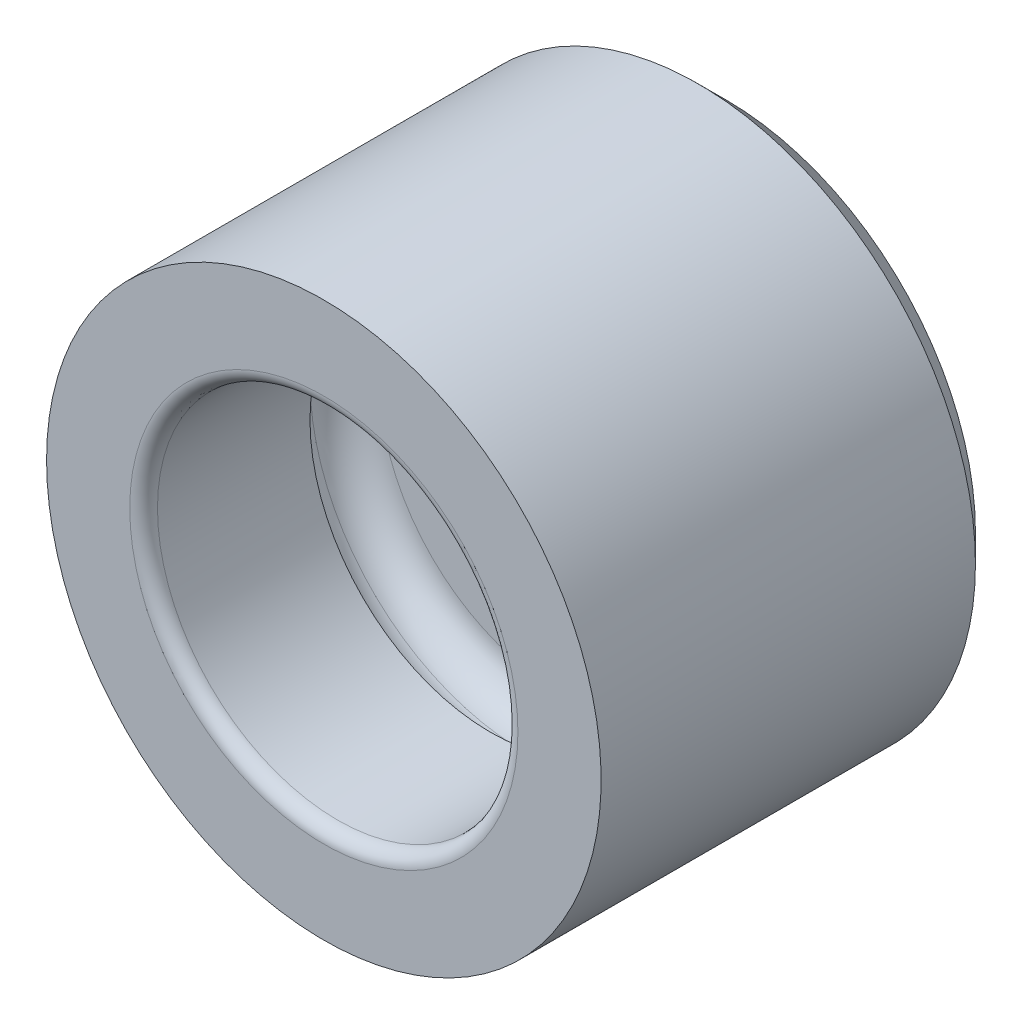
ISO-10303-21;
HEADER;
FILE_DESCRIPTION(('STEP AP214'),'2;1');
FILE_NAME('part.step','',(''),(''),'','','');
FILE_SCHEMA(('AUTOMOTIVE_DESIGN { 1 0 10303 214 1 1 1 1 }'));
ENDSEC;
DATA;
#1=APPLICATION_CONTEXT('core data for automotive mechanical design processes');
#2=APPLICATION_PROTOCOL_DEFINITION('international standard','automotive_design',2000,#1);
#3=PRODUCT_CONTEXT('',#1,'mechanical');
#4=PRODUCT('Part','Part','',(#3));
#5=PRODUCT_RELATED_PRODUCT_CATEGORY('part','',(#4));
#6=PRODUCT_DEFINITION_FORMATION('','',#4);
#7=PRODUCT_DEFINITION_CONTEXT('part definition',#1,'design');
#8=PRODUCT_DEFINITION('design','',#6,#7);
#9=PRODUCT_DEFINITION_SHAPE('','',#8);
#10=(LENGTH_UNIT() NAMED_UNIT(*) SI_UNIT(.MILLI.,.METRE.));
#11=(NAMED_UNIT(*) PLANE_ANGLE_UNIT() SI_UNIT($,.RADIAN.));
#12=(NAMED_UNIT(*) SI_UNIT($,.STERADIAN.) SOLID_ANGLE_UNIT());
#13=UNCERTAINTY_MEASURE_WITH_UNIT(LENGTH_MEASURE(1.E-05),#10,'distance_accuracy_value','');
#14=(GEOMETRIC_REPRESENTATION_CONTEXT(3) GLOBAL_UNCERTAINTY_ASSIGNED_CONTEXT((#13)) GLOBAL_UNIT_ASSIGNED_CONTEXT((#10,
#11,#12)) REPRESENTATION_CONTEXT('',''));
#15=CARTESIAN_POINT('',(0.,0.,0.));
#16=DIRECTION('',(0.,0.,1.));
#17=DIRECTION('',(1.,0.,0.));
#18=AXIS2_PLACEMENT_3D('',#15,#16,#17);
#19=CARTESIAN_POINT('',(0.,0.,-0.5));
#20=DIRECTION('',(0.,0.,-1.));
#21=DIRECTION('',(-1.,0.,0.));
#22=AXIS2_PLACEMENT_3D('',#19,#20,#21);
#23=PLANE('',#22);
#24=CARTESIAN_POINT('',(0.,0.,-0.5));
#25=DIRECTION('',(0.,0.,-1.));
#26=DIRECTION('',(-1.,0.,0.));
#27=AXIS2_PLACEMENT_3D('',#24,#25,#26);
#28=CIRCLE('',#27,7.);
#29=CARTESIAN_POINT('',(-7.,0.,-0.499999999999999));
#30=VERTEX_POINT('',#29);
#31=EDGE_CURVE('E50',#30,#30,#28,.T.);
#32=ORIENTED_EDGE('',*,*,#31,.T.);
#33=EDGE_LOOP('',(#32));
#34=FACE_BOUND('',#33,.T.);
#35=CARTESIAN_POINT('',(0.,0.,-0.5));
#36=DIRECTION('',(0.,0.,-1.));
#37=DIRECTION('',(-1.,0.,0.));
#38=AXIS2_PLACEMENT_3D('',#35,#36,#37);
#39=CIRCLE('',#38,10.);
#40=CARTESIAN_POINT('',(-10.,0.,-0.499999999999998));
#41=VERTEX_POINT('',#40);
#42=EDGE_CURVE('E63',#41,#41,#39,.T.);
#43=ORIENTED_EDGE('',*,*,#42,.F.);
#44=EDGE_LOOP('',(#43));
#45=FACE_BOUND('',#44,.T.);
#46=ADVANCED_FACE('F35',(#34,#45),#23,.F.);
#47=CARTESIAN_POINT('',(0.,0.,-0.5));
#48=DIRECTION('',(0.,0.,-1.));
#49=DIRECTION('',(-1.,0.,0.));
#50=AXIS2_PLACEMENT_3D('',#47,#48,#49);
#51=CYLINDRICAL_SURFACE('',#50,10.);
#52=CARTESIAN_POINT('',(0.,0.,-14.));
#53=DIRECTION('',(0.,0.,1.));
#54=DIRECTION('',(1.,0.,0.));
#55=AXIS2_PLACEMENT_3D('',#52,#53,#54);
#56=CIRCLE('',#55,10.);
#57=CARTESIAN_POINT('',(10.,0.,-14.));
#58=VERTEX_POINT('',#57);
#59=EDGE_CURVE('E10',#58,#58,#56,.T.);
#60=ORIENTED_EDGE('',*,*,#59,.T.);
#61=EDGE_LOOP('',(#60));
#62=FACE_BOUND('',#61,.T.);
#63=ORIENTED_EDGE('',*,*,#42,.T.);
#64=EDGE_LOOP('',(#63));
#65=FACE_BOUND('',#64,.T.);
#66=ADVANCED_FACE('F79',(#62,#65),#51,.T.);
#67=CARTESIAN_POINT('',(0.,0.,-15.));
#68=DIRECTION('',(0.,0.,1.));
#69=DIRECTION('',(1.,0.,0.));
#70=AXIS2_PLACEMENT_3D('',#67,#68,#69);
#71=PLANE('',#70);
#72=CARTESIAN_POINT('',(0.,0.,-15.));
#73=DIRECTION('',(0.,0.,1.));
#74=DIRECTION('',(1.,0.,0.));
#75=AXIS2_PLACEMENT_3D('',#72,#73,#74);
#76=CIRCLE('',#75,9.);
#77=CARTESIAN_POINT('',(9.,0.,-15.));
#78=VERTEX_POINT('',#77);
#79=EDGE_CURVE('E42',#78,#78,#76,.F.);
#80=ORIENTED_EDGE('',*,*,#79,.T.);
#81=EDGE_LOOP('',(#80));
#82=FACE_BOUND('',#81,.T.);
#83=CARTESIAN_POINT('',(0.,0.,-15.));
#84=DIRECTION('',(0.,0.,-1.));
#85=DIRECTION('',(-1.,0.,0.));
#86=AXIS2_PLACEMENT_3D('',#83,#84,#85);
#87=CIRCLE('',#86,2.5);
#88=CARTESIAN_POINT('',(-2.5,0.,-15.));
#89=VERTEX_POINT('',#88);
#90=EDGE_CURVE('E70',#89,#89,#87,.T.);
#91=ORIENTED_EDGE('',*,*,#90,.F.);
#92=EDGE_LOOP('',(#91));
#93=FACE_BOUND('',#92,.T.);
#94=ADVANCED_FACE('F76',(#82,#93),#71,.F.);
#95=CARTESIAN_POINT('',(0.,0.,-9.));
#96=DIRECTION('',(0.,0.,1.));
#97=DIRECTION('',(1.,0.,0.));
#98=AXIS2_PLACEMENT_3D('',#95,#96,#97);
#99=PLANE('',#98);
#100=CARTESIAN_POINT('',(0.,0.,-9.));
#101=DIRECTION('',(0.,0.,1.));
#102=DIRECTION('',(1.,0.,0.));
#103=AXIS2_PLACEMENT_3D('',#100,#101,#102);
#104=CIRCLE('',#103,2.5);
#105=CARTESIAN_POINT('',(2.49999999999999,0.,-9.));
#106=VERTEX_POINT('',#105);
#107=EDGE_CURVE('E60',#106,#106,#104,.T.);
#108=ORIENTED_EDGE('',*,*,#107,.F.);
#109=EDGE_LOOP('',(#108));
#110=FACE_BOUND('',#109,.T.);
#111=CARTESIAN_POINT('',(0.,0.,-9.));
#112=DIRECTION('',(0.,0.,1.));
#113=DIRECTION('',(1.,0.,0.));
#114=AXIS2_PLACEMENT_3D('',#111,#112,#113);
#115=CIRCLE('',#114,6.5);
#116=CARTESIAN_POINT('',(6.5,0.,-9.));
#117=VERTEX_POINT('',#116);
#118=EDGE_CURVE('E55',#117,#117,#115,.T.);
#119=ORIENTED_EDGE('',*,*,#118,.T.);
#120=EDGE_LOOP('',(#119));
#121=FACE_BOUND('',#120,.T.);
#122=ADVANCED_FACE('F78',(#110,#121),#99,.T.);
#123=CARTESIAN_POINT('',(0.,0.,-0.5));
#124=DIRECTION('',(0.,0.,-1.));
#125=DIRECTION('',(-1.,0.,0.));
#126=AXIS2_PLACEMENT_3D('',#123,#124,#125);
#127=CYLINDRICAL_SURFACE('',#126,6.5);
#128=CARTESIAN_POINT('',(0.,0.,-1.));
#129=DIRECTION('',(0.,0.,-1.));
#130=DIRECTION('',(-1.,0.,0.));
#131=AXIS2_PLACEMENT_3D('',#128,#129,#130);
#132=CIRCLE('',#131,6.5);
#133=CARTESIAN_POINT('',(-6.5,0.,-0.999999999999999));
#134=VERTEX_POINT('',#133);
#135=EDGE_CURVE('E46',#134,#134,#132,.F.);
#136=ORIENTED_EDGE('',*,*,#135,.T.);
#137=EDGE_LOOP('',(#136));
#138=FACE_BOUND('',#137,.T.);
#139=CARTESIAN_POINT('',(0.,0.,-6.5));
#140=DIRECTION('',(0.,0.,-1.));
#141=DIRECTION('',(-1.,0.,0.));
#142=AXIS2_PLACEMENT_3D('',#139,#140,#141);
#143=CIRCLE('',#142,6.5);
#144=CARTESIAN_POINT('',(-6.5,0.,-6.5));
#145=VERTEX_POINT('',#144);
#146=EDGE_CURVE('E59',#145,#145,#143,.T.);
#147=ORIENTED_EDGE('',*,*,#146,.T.);
#148=EDGE_LOOP('',(#147));
#149=FACE_BOUND('',#148,.T.);
#150=ADVANCED_FACE('F85',(#138,#149),#127,.F.);
#151=CARTESIAN_POINT('',(0.,0.,-7.75));
#152=DIRECTION('',(0.,0.,1.));
#153=DIRECTION('',(1.,0.,0.));
#154=AXIS2_PLACEMENT_3D('',#151,#152,#153);
#155=TOROIDAL_SURFACE('',#154,6.5,1.25);
#156=ORIENTED_EDGE('',*,*,#118,.F.);
#157=EDGE_LOOP('',(#156));
#158=FACE_BOUND('',#157,.T.);
#159=CARTESIAN_POINT('',(0.,0.,-7.75));
#160=DIRECTION('',(0.,0.,1.));
#161=DIRECTION('',(1.,0.,0.));
#162=AXIS2_PLACEMENT_3D('',#159,#160,#161);
#163=CIRCLE('',#162,7.75);
#164=CARTESIAN_POINT('',(7.75,0.,-7.75));
#165=VERTEX_POINT('',#164);
#166=EDGE_CURVE('E56',#165,#165,#163,.F.);
#167=ORIENTED_EDGE('',*,*,#166,.F.);
#168=EDGE_LOOP('',(#167));
#169=FACE_BOUND('',#168,.T.);
#170=ADVANCED_FACE('F99',(#158,#169),#155,.F.);
#171=CARTESIAN_POINT('',(0.,0.,-7.75));
#172=DIRECTION('',(0.,0.,-1.));
#173=DIRECTION('',(-1.,0.,0.));
#174=AXIS2_PLACEMENT_3D('',#171,#172,#173);
#175=TOROIDAL_SURFACE('',#174,6.5,1.25);
#176=ORIENTED_EDGE('',*,*,#166,.T.);
#177=EDGE_LOOP('',(#176));
#178=FACE_BOUND('',#177,.T.);
#179=ORIENTED_EDGE('',*,*,#146,.F.);
#180=EDGE_LOOP('',(#179));
#181=FACE_BOUND('',#180,.T.);
#182=ADVANCED_FACE('F96',(#178,#181),#175,.F.);
#183=CARTESIAN_POINT('',(0.,0.,-15.));
#184=DIRECTION('',(0.,0.,-1.));
#185=DIRECTION('',(-1.,0.,0.));
#186=AXIS2_PLACEMENT_3D('',#183,#184,#185);
#187=CYLINDRICAL_SURFACE('',#186,2.5);
#188=ORIENTED_EDGE('',*,*,#107,.T.);
#189=EDGE_LOOP('',(#188));
#190=FACE_BOUND('',#189,.T.);
#191=ORIENTED_EDGE('',*,*,#90,.T.);
#192=EDGE_LOOP('',(#191));
#193=FACE_BOUND('',#192,.T.);
#194=ADVANCED_FACE('F74',(#190,#193),#187,.F.);
#195=CARTESIAN_POINT('',(0.,0.,-1.));
#196=DIRECTION('',(0.,0.,-1.));
#197=DIRECTION('',(-1.,0.,0.));
#198=AXIS2_PLACEMENT_3D('',#195,#196,#197);
#199=TOROIDAL_SURFACE('',#198,7.,0.5);
#200=ORIENTED_EDGE('',*,*,#135,.F.);
#201=EDGE_LOOP('',(#200));
#202=FACE_BOUND('',#201,.T.);
#203=ORIENTED_EDGE('',*,*,#31,.F.);
#204=EDGE_LOOP('',(#203));
#205=FACE_BOUND('',#204,.T.);
#206=ADVANCED_FACE('F103',(#202,#205),#199,.T.);
#207=CARTESIAN_POINT('',(0.,0.,-15.));
#208=DIRECTION('',(0.,0.,1.));
#209=DIRECTION('',(1.,0.,0.));
#210=AXIS2_PLACEMENT_3D('',#207,#208,#209);
#211=CONICAL_SURFACE('',#210,9.,0.785398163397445);
#212=ORIENTED_EDGE('',*,*,#59,.F.);
#213=EDGE_LOOP('',(#212));
#214=FACE_BOUND('',#213,.T.);
#215=ORIENTED_EDGE('',*,*,#79,.F.);
#216=EDGE_LOOP('',(#215));
#217=FACE_BOUND('',#216,.T.);
#218=ADVANCED_FACE('F37',(#214,#217),#211,.T.);
#219=CLOSED_SHELL('',(#46,#66,#94,#122,#150,#170,#182,#194,#206,#218));
#220=MANIFOLD_SOLID_BREP('B2',#219);
#221=ADVANCED_BREP_SHAPE_REPRESENTATION('',(#18,#220),#14);
#222=SHAPE_DEFINITION_REPRESENTATION(#9,#221);
ENDSEC;
END-ISO-10303-21;
